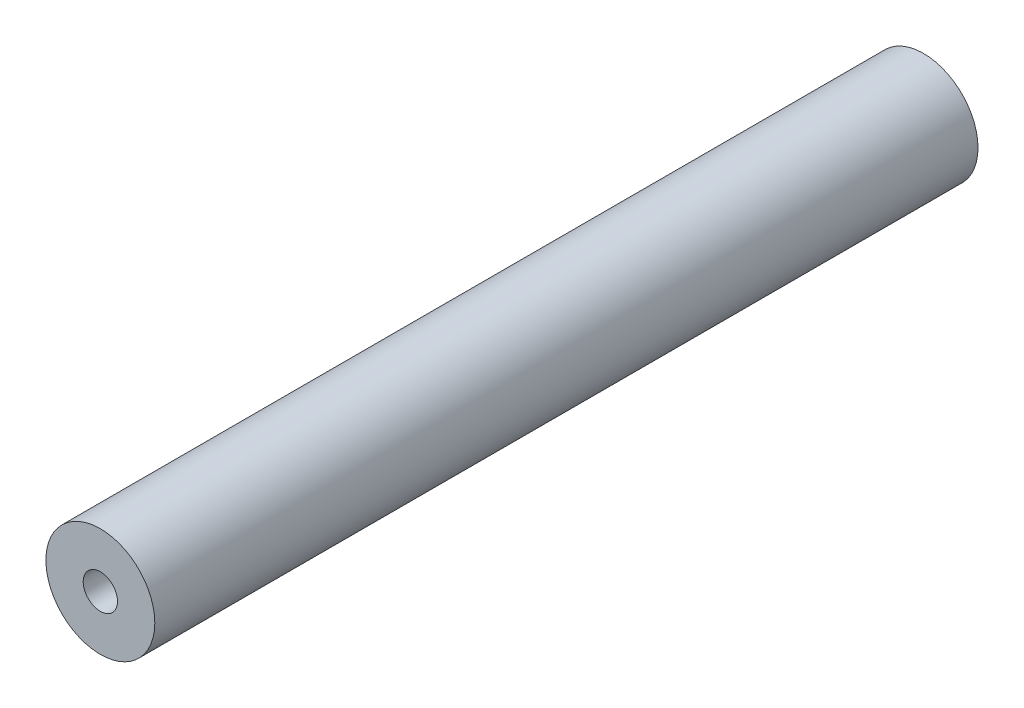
ISO-10303-21;
HEADER;
FILE_DESCRIPTION(('STEP AP214'),'2;1');
FILE_NAME('part.step','',(''),(''),'','','');
FILE_SCHEMA(('AUTOMOTIVE_DESIGN { 1 0 10303 214 1 1 1 1 }'));
ENDSEC;
DATA;
#1=APPLICATION_CONTEXT('core data for automotive mechanical design processes');
#2=APPLICATION_PROTOCOL_DEFINITION('international standard','automotive_design',2000,#1);
#3=PRODUCT_CONTEXT('',#1,'mechanical');
#4=PRODUCT('Part','Part','',(#3));
#5=PRODUCT_RELATED_PRODUCT_CATEGORY('part','',(#4));
#6=PRODUCT_DEFINITION_FORMATION('','',#4);
#7=PRODUCT_DEFINITION_CONTEXT('part definition',#1,'design');
#8=PRODUCT_DEFINITION('design','',#6,#7);
#9=PRODUCT_DEFINITION_SHAPE('','',#8);
#10=(LENGTH_UNIT() NAMED_UNIT(*) SI_UNIT(.MILLI.,.METRE.));
#11=(NAMED_UNIT(*) PLANE_ANGLE_UNIT() SI_UNIT($,.RADIAN.));
#12=(NAMED_UNIT(*) SI_UNIT($,.STERADIAN.) SOLID_ANGLE_UNIT());
#13=UNCERTAINTY_MEASURE_WITH_UNIT(LENGTH_MEASURE(1.E-05),#10,'distance_accuracy_value','');
#14=(GEOMETRIC_REPRESENTATION_CONTEXT(3) GLOBAL_UNCERTAINTY_ASSIGNED_CONTEXT((#13)) GLOBAL_UNIT_ASSIGNED_CONTEXT((#10,
#11,#12)) REPRESENTATION_CONTEXT('',''));
#15=CARTESIAN_POINT('',(0.,0.,0.));
#16=DIRECTION('',(0.,0.,1.));
#17=DIRECTION('',(1.,0.,0.));
#18=AXIS2_PLACEMENT_3D('',#15,#16,#17);
#19=CARTESIAN_POINT('',(0.,0.,30.));
#20=DIRECTION('',(0.,0.,-1.));
#21=DIRECTION('',(-1.,0.,0.));
#22=AXIS2_PLACEMENT_3D('',#19,#20,#21);
#23=CYLINDRICAL_SURFACE('',#22,3.96875);
#24=CARTESIAN_POINT('',(0.,0.,30.));
#25=DIRECTION('',(0.,0.,1.));
#26=DIRECTION('',(1.,0.,0.));
#27=AXIS2_PLACEMENT_3D('',#24,#25,#26);
#28=CIRCLE('',#27,3.96875);
#29=CARTESIAN_POINT('',(3.96875,0.,30.));
#30=VERTEX_POINT('',#29);
#31=EDGE_CURVE('E11',#30,#30,#28,.T.);
#32=ORIENTED_EDGE('',*,*,#31,.F.);
#33=EDGE_LOOP('',(#32));
#34=FACE_BOUND('',#33,.T.);
#35=CARTESIAN_POINT('',(0.,0.,-30.));
#36=DIRECTION('',(0.,0.,1.));
#37=DIRECTION('',(1.,0.,0.));
#38=AXIS2_PLACEMENT_3D('',#35,#36,#37);
#39=CIRCLE('',#38,3.96875);
#40=CARTESIAN_POINT('',(3.96875,0.,-30.));
#41=VERTEX_POINT('',#40);
#42=EDGE_CURVE('E43',#41,#41,#39,.T.);
#43=ORIENTED_EDGE('',*,*,#42,.T.);
#44=EDGE_LOOP('',(#43));
#45=FACE_BOUND('',#44,.T.);
#46=ADVANCED_FACE('F40',(#34,#45),#23,.T.);
#47=CARTESIAN_POINT('',(0.,0.,30.));
#48=DIRECTION('',(0.,0.,1.));
#49=DIRECTION('',(1.,0.,0.));
#50=AXIS2_PLACEMENT_3D('',#47,#48,#49);
#51=PLANE('',#50);
#52=CARTESIAN_POINT('',(0.,0.,30.));
#53=DIRECTION('',(0.,0.,1.));
#54=DIRECTION('',(1.,0.,0.));
#55=AXIS2_PLACEMENT_3D('',#52,#53,#54);
#56=CIRCLE('',#55,1.25);
#57=CARTESIAN_POINT('',(1.25,0.,30.));
#58=VERTEX_POINT('',#57);
#59=EDGE_CURVE('E63',#58,#58,#56,.T.);
#60=ORIENTED_EDGE('',*,*,#59,.F.);
#61=EDGE_LOOP('',(#60));
#62=FACE_BOUND('',#61,.T.);
#63=ORIENTED_EDGE('',*,*,#31,.T.);
#64=EDGE_LOOP('',(#63));
#65=FACE_BOUND('',#64,.T.);
#66=ADVANCED_FACE('F82',(#62,#65),#51,.T.);
#67=CARTESIAN_POINT('',(0.,0.,-30.));
#68=DIRECTION('',(0.,0.,1.));
#69=DIRECTION('',(1.,0.,0.));
#70=AXIS2_PLACEMENT_3D('',#67,#68,#69);
#71=PLANE('',#70);
#72=CARTESIAN_POINT('',(0.,0.,-30.));
#73=DIRECTION('',(0.,0.,-1.));
#74=DIRECTION('',(-1.,0.,0.));
#75=AXIS2_PLACEMENT_3D('',#72,#73,#74);
#76=CIRCLE('',#75,1.24999999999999);
#77=CARTESIAN_POINT('',(-1.24999999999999,0.,-30.));
#78=VERTEX_POINT('',#77);
#79=EDGE_CURVE('E64',#78,#78,#76,.T.);
#80=ORIENTED_EDGE('',*,*,#79,.F.);
#81=EDGE_LOOP('',(#80));
#82=FACE_BOUND('',#81,.T.);
#83=ORIENTED_EDGE('',*,*,#42,.F.);
#84=EDGE_LOOP('',(#83));
#85=FACE_BOUND('',#84,.T.);
#86=ADVANCED_FACE('F79',(#82,#85),#71,.F.);
#87=CARTESIAN_POINT('',(0.,0.,22.49938));
#88=DIRECTION('',(0.,0.,1.));
#89=DIRECTION('',(1.,0.,0.));
#90=AXIS2_PLACEMENT_3D('',#87,#88,#89);
#91=CONICAL_SURFACE('',#90,1.25,1.02974425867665);
#92=CARTESIAN_POINT('',(0.,0.,21.7483042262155));
#93=VERTEX_POINT('',#92);
#94=VERTEX_LOOP('',#93);
#95=FACE_BOUND('',#94,.T.);
#96=CARTESIAN_POINT('',(0.,0.,22.49938));
#97=DIRECTION('',(0.,0.,1.));
#98=DIRECTION('',(1.,0.,0.));
#99=AXIS2_PLACEMENT_3D('',#96,#97,#98);
#100=CIRCLE('',#99,1.25);
#101=CARTESIAN_POINT('',(1.25,0.,22.49938));
#102=VERTEX_POINT('',#101);
#103=EDGE_CURVE('E67',#102,#102,#100,.T.);
#104=ORIENTED_EDGE('',*,*,#103,.T.);
#105=EDGE_LOOP('',(#104));
#106=FACE_BOUND('',#105,.T.);
#107=ADVANCED_FACE('F81',(#95,#106),#91,.F.);
#108=CARTESIAN_POINT('',(0.,0.,30.));
#109=DIRECTION('',(0.,0.,1.));
#110=DIRECTION('',(1.,0.,0.));
#111=AXIS2_PLACEMENT_3D('',#108,#109,#110);
#112=CYLINDRICAL_SURFACE('',#111,1.25);
#113=ORIENTED_EDGE('',*,*,#103,.F.);
#114=EDGE_LOOP('',(#113));
#115=FACE_BOUND('',#114,.T.);
#116=ORIENTED_EDGE('',*,*,#59,.T.);
#117=EDGE_LOOP('',(#116));
#118=FACE_BOUND('',#117,.T.);
#119=ADVANCED_FACE('F57',(#115,#118),#112,.F.);
#120=CARTESIAN_POINT('',(0.,0.,-22.49938));
#121=DIRECTION('',(0.,0.,-1.));
#122=DIRECTION('',(-1.,0.,0.));
#123=AXIS2_PLACEMENT_3D('',#120,#121,#122);
#124=CONICAL_SURFACE('',#123,1.24999999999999,1.02974425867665);
#125=CARTESIAN_POINT('',(0.,0.,-21.7483042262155));
#126=VERTEX_POINT('',#125);
#127=VERTEX_LOOP('',#126);
#128=FACE_BOUND('',#127,.T.);
#129=CARTESIAN_POINT('',(0.,0.,-22.49938));
#130=DIRECTION('',(0.,0.,-1.));
#131=DIRECTION('',(-1.,0.,0.));
#132=AXIS2_PLACEMENT_3D('',#129,#130,#131);
#133=CIRCLE('',#132,1.24999999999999);
#134=CARTESIAN_POINT('',(-1.24999999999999,0.,-22.49938));
#135=VERTEX_POINT('',#134);
#136=EDGE_CURVE('E61',#135,#135,#133,.T.);
#137=ORIENTED_EDGE('',*,*,#136,.T.);
#138=EDGE_LOOP('',(#137));
#139=FACE_BOUND('',#138,.T.);
#140=ADVANCED_FACE('F53',(#128,#139),#124,.F.);
#141=CARTESIAN_POINT('',(0.,0.,-30.));
#142=DIRECTION('',(0.,0.,-1.));
#143=DIRECTION('',(-1.,0.,0.));
#144=AXIS2_PLACEMENT_3D('',#141,#142,#143);
#145=CYLINDRICAL_SURFACE('',#144,1.24999999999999);
#146=ORIENTED_EDGE('',*,*,#136,.F.);
#147=EDGE_LOOP('',(#146));
#148=FACE_BOUND('',#147,.T.);
#149=ORIENTED_EDGE('',*,*,#79,.T.);
#150=EDGE_LOOP('',(#149));
#151=FACE_BOUND('',#150,.T.);
#152=ADVANCED_FACE('F56',(#148,#151),#145,.F.);
#153=CLOSED_SHELL('',(#46,#66,#86,#107,#119,#140,#152));
#154=MANIFOLD_SOLID_BREP('B2',#153);
#155=ADVANCED_BREP_SHAPE_REPRESENTATION('',(#18,#154),#14);
#156=SHAPE_DEFINITION_REPRESENTATION(#9,#155);
ENDSEC;
END-ISO-10303-21;
